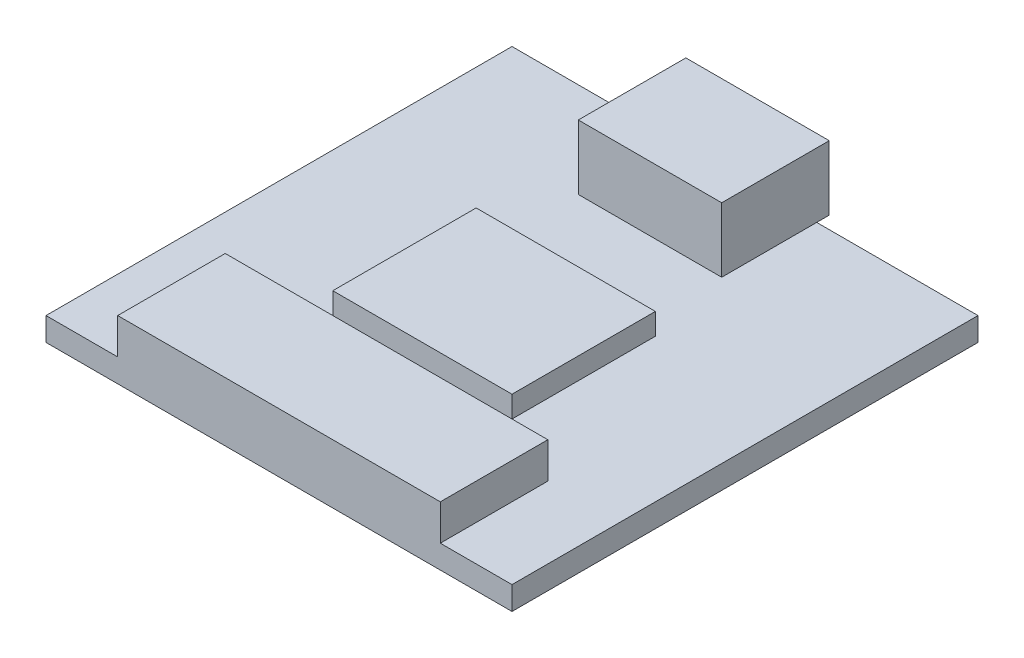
ISO-10303-21;
HEADER;
FILE_DESCRIPTION(('STEP AP214'),'2;1');
FILE_NAME('part.step','',(''),(''),'','','');
FILE_SCHEMA(('AUTOMOTIVE_DESIGN { 1 0 10303 214 1 1 1 1 }'));
ENDSEC;
DATA;
#1=APPLICATION_CONTEXT('core data for automotive mechanical design processes');
#2=APPLICATION_PROTOCOL_DEFINITION('international standard','automotive_design',2000,#1);
#3=PRODUCT_CONTEXT('',#1,'mechanical');
#4=PRODUCT('Part','Part','',(#3));
#5=PRODUCT_RELATED_PRODUCT_CATEGORY('part','',(#4));
#6=PRODUCT_DEFINITION_FORMATION('','',#4);
#7=PRODUCT_DEFINITION_CONTEXT('part definition',#1,'design');
#8=PRODUCT_DEFINITION('design','',#6,#7);
#9=PRODUCT_DEFINITION_SHAPE('','',#8);
#10=(LENGTH_UNIT() NAMED_UNIT(*) SI_UNIT(.MILLI.,.METRE.));
#11=(NAMED_UNIT(*) PLANE_ANGLE_UNIT() SI_UNIT($,.RADIAN.));
#12=(NAMED_UNIT(*) SI_UNIT($,.STERADIAN.) SOLID_ANGLE_UNIT());
#13=UNCERTAINTY_MEASURE_WITH_UNIT(LENGTH_MEASURE(1.E-05),#10,'distance_accuracy_value','');
#14=(GEOMETRIC_REPRESENTATION_CONTEXT(3) GLOBAL_UNCERTAINTY_ASSIGNED_CONTEXT((#13)) GLOBAL_UNIT_ASSIGNED_CONTEXT((#10,
#11,#12)) REPRESENTATION_CONTEXT('',''));
#15=CARTESIAN_POINT('',(0.,0.,0.));
#16=DIRECTION('',(0.,0.,1.));
#17=DIRECTION('',(1.,0.,0.));
#18=AXIS2_PLACEMENT_3D('',#15,#16,#17);
#19=CARTESIAN_POINT('',(-4.,9.,-68.7));
#20=DIRECTION('',(0.,1.,0.));
#21=DIRECTION('',(0.,0.,1.));
#22=AXIS2_PLACEMENT_3D('',#19,#20,#21);
#23=PLANE('',#22);
#24=DIRECTION('',(1.,0.,0.));
#25=VECTOR('',#24,1.);
#26=CARTESIAN_POINT('',(-4.,9.,-62.7));
#27=LINE('',#26,#25);
#28=CARTESIAN_POINT('',(4.,9.,-62.7));
#29=VERTEX_POINT('',#28);
#30=CARTESIAN_POINT('',(-4.,9.,-62.7));
#31=VERTEX_POINT('',#30);
#32=EDGE_CURVE('E150',#29,#31,#27,.F.);
#33=ORIENTED_EDGE('',*,*,#32,.F.);
#34=DIRECTION('',(0.,0.,-1.));
#35=VECTOR('',#34,1.);
#36=CARTESIAN_POINT('',(4.,9.,-68.7));
#37=LINE('',#36,#35);
#38=CARTESIAN_POINT('',(4.,9.,-68.7));
#39=VERTEX_POINT('',#38);
#40=EDGE_CURVE('E132',#39,#29,#37,.F.);
#41=ORIENTED_EDGE('',*,*,#40,.F.);
#42=DIRECTION('',(1.,0.,0.));
#43=VECTOR('',#42,1.);
#44=CARTESIAN_POINT('',(-4.,9.,-68.7));
#45=LINE('',#44,#43);
#46=CARTESIAN_POINT('',(-4.,9.,-68.7));
#47=VERTEX_POINT('',#46);
#48=EDGE_CURVE('E19',#39,#47,#45,.F.);
#49=ORIENTED_EDGE('',*,*,#48,.T.);
#50=DIRECTION('',(0.,0.,-1.));
#51=VECTOR('',#50,1.);
#52=CARTESIAN_POINT('',(-4.,9.,-68.7));
#53=LINE('',#52,#51);
#54=EDGE_CURVE('E157',#47,#31,#53,.F.);
#55=ORIENTED_EDGE('',*,*,#54,.T.);
#56=EDGE_LOOP('',(#33,#41,#49,#55));
#57=FACE_BOUND('',#56,.T.);
#58=ADVANCED_FACE('F16',(#57),#23,.T.);
#59=CARTESIAN_POINT('',(-5.,6.6,-58.));
#60=DIRECTION('',(0.,1.,0.));
#61=DIRECTION('',(0.,0.,1.));
#62=AXIS2_PLACEMENT_3D('',#59,#60,#61);
#63=PLANE('',#62);
#64=DIRECTION('',(1.,0.,0.));
#65=VECTOR('',#64,1.);
#66=CARTESIAN_POINT('',(-5.,6.6,-50.));
#67=LINE('',#66,#65);
#68=CARTESIAN_POINT('',(5.,6.6,-50.));
#69=VERTEX_POINT('',#68);
#70=CARTESIAN_POINT('',(-5.,6.6,-50.));
#71=VERTEX_POINT('',#70);
#72=EDGE_CURVE('E175',#69,#71,#67,.F.);
#73=ORIENTED_EDGE('',*,*,#72,.F.);
#74=DIRECTION('',(0.,0.,-1.));
#75=VECTOR('',#74,1.);
#76=CARTESIAN_POINT('',(5.,6.6,-58.));
#77=LINE('',#76,#75);
#78=CARTESIAN_POINT('',(5.,6.6,-58.));
#79=VERTEX_POINT('',#78);
#80=EDGE_CURVE('E192',#79,#69,#77,.F.);
#81=ORIENTED_EDGE('',*,*,#80,.F.);
#82=DIRECTION('',(1.,0.,0.));
#83=VECTOR('',#82,1.);
#84=CARTESIAN_POINT('',(-5.,6.6,-58.));
#85=LINE('',#84,#83);
#86=CARTESIAN_POINT('',(-5.,6.6,-58.));
#87=VERTEX_POINT('',#86);
#88=EDGE_CURVE('E186',#79,#87,#85,.F.);
#89=ORIENTED_EDGE('',*,*,#88,.T.);
#90=DIRECTION('',(0.,0.,-1.));
#91=VECTOR('',#90,1.);
#92=CARTESIAN_POINT('',(-5.,6.6,-58.));
#93=LINE('',#92,#91);
#94=EDGE_CURVE('E177',#87,#71,#93,.F.);
#95=ORIENTED_EDGE('',*,*,#94,.T.);
#96=EDGE_LOOP('',(#73,#81,#89,#95));
#97=FACE_BOUND('',#96,.T.);
#98=ADVANCED_FACE('F348',(#97),#63,.T.);
#99=CARTESIAN_POINT('',(-4.,5.4,-68.7));
#100=DIRECTION('',(0.,0.,1.));
#101=DIRECTION('',(1.,0.,0.));
#102=AXIS2_PLACEMENT_3D('',#99,#100,#101);
#103=PLANE('',#102);
#104=DIRECTION('',(0.,1.,0.));
#105=VECTOR('',#104,1.);
#106=CARTESIAN_POINT('',(4.,5.4,-68.7));
#107=LINE('',#106,#105);
#108=CARTESIAN_POINT('',(4.,5.4,-68.7));
#109=VERTEX_POINT('',#108);
#110=EDGE_CURVE('E139',#109,#39,#107,.T.);
#111=ORIENTED_EDGE('',*,*,#110,.F.);
#112=DIRECTION('',(1.,0.,0.));
#113=VECTOR('',#112,1.);
#114=CARTESIAN_POINT('',(-4.,5.4,-68.7));
#115=LINE('',#114,#113);
#116=CARTESIAN_POINT('',(-4.,5.4,-68.7));
#117=VERTEX_POINT('',#116);
#118=EDGE_CURVE('E197',#109,#117,#115,.F.);
#119=ORIENTED_EDGE('',*,*,#118,.T.);
#120=DIRECTION('',(0.,1.,0.));
#121=VECTOR('',#120,1.);
#122=CARTESIAN_POINT('',(-4.,5.4,-68.7));
#123=LINE('',#122,#121);
#124=EDGE_CURVE('E141',#117,#47,#123,.T.);
#125=ORIENTED_EDGE('',*,*,#124,.T.);
#126=ORIENTED_EDGE('',*,*,#48,.F.);
#127=EDGE_LOOP('',(#111,#119,#125,#126));
#128=FACE_BOUND('',#127,.T.);
#129=ADVANCED_FACE('F137',(#128),#103,.F.);
#130=CARTESIAN_POINT('',(-9.,7.4,-48.));
#131=DIRECTION('',(0.,1.,0.));
#132=DIRECTION('',(0.,0.,1.));
#133=AXIS2_PLACEMENT_3D('',#130,#131,#132);
#134=PLANE('',#133);
#135=DIRECTION('',(1.,0.,0.));
#136=VECTOR('',#135,1.);
#137=CARTESIAN_POINT('',(-9.,7.4,-42.));
#138=LINE('',#137,#136);
#139=CARTESIAN_POINT('',(9.,7.4,-42.));
#140=VERTEX_POINT('',#139);
#141=CARTESIAN_POINT('',(-9.,7.4,-42.));
#142=VERTEX_POINT('',#141);
#143=EDGE_CURVE('E207',#140,#142,#138,.F.);
#144=ORIENTED_EDGE('',*,*,#143,.F.);
#145=DIRECTION('',(0.,0.,-1.));
#146=VECTOR('',#145,1.);
#147=CARTESIAN_POINT('',(9.,7.4,-48.));
#148=LINE('',#147,#146);
#149=CARTESIAN_POINT('',(9.,7.4,-48.));
#150=VERTEX_POINT('',#149);
#151=EDGE_CURVE('E173',#150,#140,#148,.F.);
#152=ORIENTED_EDGE('',*,*,#151,.F.);
#153=DIRECTION('',(1.,0.,0.));
#154=VECTOR('',#153,1.);
#155=CARTESIAN_POINT('',(-9.,7.4,-48.));
#156=LINE('',#155,#154);
#157=CARTESIAN_POINT('',(-9.,7.4,-48.));
#158=VERTEX_POINT('',#157);
#159=EDGE_CURVE('E167',#150,#158,#156,.F.);
#160=ORIENTED_EDGE('',*,*,#159,.T.);
#161=DIRECTION('',(0.,0.,-1.));
#162=VECTOR('',#161,1.);
#163=CARTESIAN_POINT('',(-9.,7.4,-48.));
#164=LINE('',#163,#162);
#165=EDGE_CURVE('E162',#158,#142,#164,.F.);
#166=ORIENTED_EDGE('',*,*,#165,.T.);
#167=EDGE_LOOP('',(#144,#152,#160,#166));
#168=FACE_BOUND('',#167,.T.);
#169=ADVANCED_FACE('F343',(#168),#134,.T.);
#170=CARTESIAN_POINT('',(4.,5.4,-68.7));
#171=DIRECTION('',(1.,0.,0.));
#172=DIRECTION('',(0.,0.,-1.));
#173=AXIS2_PLACEMENT_3D('',#170,#171,#172);
#174=PLANE('',#173);
#175=DIRECTION('',(0.,1.,0.));
#176=VECTOR('',#175,1.);
#177=CARTESIAN_POINT('',(4.,5.4,-62.7));
#178=LINE('',#177,#176);
#179=CARTESIAN_POINT('',(4.,5.4,-62.7));
#180=VERTEX_POINT('',#179);
#181=EDGE_CURVE('E151',#180,#29,#178,.T.);
#182=ORIENTED_EDGE('',*,*,#181,.F.);
#183=DIRECTION('',(0.,0.,1.));
#184=VECTOR('',#183,1.);
#185=CARTESIAN_POINT('',(4.,5.4,-68.));
#186=LINE('',#185,#184);
#187=CARTESIAN_POINT('',(4.,5.4,-68.));
#188=VERTEX_POINT('',#187);
#189=EDGE_CURVE('E210',#188,#180,#186,.T.);
#190=ORIENTED_EDGE('',*,*,#189,.F.);
#191=DIRECTION('',(0.,0.,1.));
#192=VECTOR('',#191,1.);
#193=CARTESIAN_POINT('',(4.,5.4,-68.7));
#194=LINE('',#193,#192);
#195=EDGE_CURVE('E148',#188,#109,#194,.F.);
#196=ORIENTED_EDGE('',*,*,#195,.T.);
#197=ORIENTED_EDGE('',*,*,#110,.T.);
#198=ORIENTED_EDGE('',*,*,#40,.T.);
#199=EDGE_LOOP('',(#182,#190,#196,#197,#198));
#200=FACE_BOUND('',#199,.T.);
#201=ADVANCED_FACE('F146',(#200),#174,.T.);
#202=CARTESIAN_POINT('',(-4.,5.4,-62.7));
#203=DIRECTION('',(0.,0.,1.));
#204=DIRECTION('',(1.,0.,0.));
#205=AXIS2_PLACEMENT_3D('',#202,#203,#204);
#206=PLANE('',#205);
#207=ORIENTED_EDGE('',*,*,#181,.T.);
#208=ORIENTED_EDGE('',*,*,#32,.T.);
#209=DIRECTION('',(0.,1.,0.));
#210=VECTOR('',#209,1.);
#211=CARTESIAN_POINT('',(-4.,5.4,-62.7));
#212=LINE('',#211,#210);
#213=CARTESIAN_POINT('',(-4.,5.4,-62.7));
#214=VERTEX_POINT('',#213);
#215=EDGE_CURVE('E159',#31,#214,#212,.F.);
#216=ORIENTED_EDGE('',*,*,#215,.T.);
#217=DIRECTION('',(1.,0.,0.));
#218=VECTOR('',#217,1.);
#219=CARTESIAN_POINT('',(-13.,5.4,-62.7));
#220=LINE('',#219,#218);
#221=EDGE_CURVE('E212',#180,#214,#220,.F.);
#222=ORIENTED_EDGE('',*,*,#221,.F.);
#223=EDGE_LOOP('',(#207,#208,#216,#222));
#224=FACE_BOUND('',#223,.T.);
#225=ADVANCED_FACE('F336',(#224),#206,.T.);
#226=CARTESIAN_POINT('',(-4.,5.4,-68.7));
#227=DIRECTION('',(1.,0.,0.));
#228=DIRECTION('',(0.,0.,-1.));
#229=AXIS2_PLACEMENT_3D('',#226,#227,#228);
#230=PLANE('',#229);
#231=ORIENTED_EDGE('',*,*,#215,.F.);
#232=ORIENTED_EDGE('',*,*,#54,.F.);
#233=ORIENTED_EDGE('',*,*,#124,.F.);
#234=DIRECTION('',(0.,0.,1.));
#235=VECTOR('',#234,1.);
#236=CARTESIAN_POINT('',(-4.,5.4,-68.7));
#237=LINE('',#236,#235);
#238=CARTESIAN_POINT('',(-4.,5.4,-68.));
#239=VERTEX_POINT('',#238);
#240=EDGE_CURVE('E199',#117,#239,#237,.T.);
#241=ORIENTED_EDGE('',*,*,#240,.T.);
#242=DIRECTION('',(0.,0.,1.));
#243=VECTOR('',#242,1.);
#244=CARTESIAN_POINT('',(-4.,5.4,-68.));
#245=LINE('',#244,#243);
#246=EDGE_CURVE('E214',#214,#239,#245,.F.);
#247=ORIENTED_EDGE('',*,*,#246,.F.);
#248=EDGE_LOOP('',(#231,#232,#233,#241,#247));
#249=FACE_BOUND('',#248,.T.);
#250=ADVANCED_FACE('F332',(#249),#230,.F.);
#251=CARTESIAN_POINT('',(-9.,5.4,-48.));
#252=DIRECTION('',(1.,0.,0.));
#253=DIRECTION('',(0.,0.,-1.));
#254=AXIS2_PLACEMENT_3D('',#251,#252,#253);
#255=PLANE('',#254);
#256=ORIENTED_EDGE('',*,*,#165,.F.);
#257=DIRECTION('',(0.,1.,0.));
#258=VECTOR('',#257,1.);
#259=CARTESIAN_POINT('',(-9.,5.4,-48.));
#260=LINE('',#259,#258);
#261=CARTESIAN_POINT('',(-9.,5.4,-48.));
#262=VERTEX_POINT('',#261);
#263=EDGE_CURVE('E164',#158,#262,#260,.F.);
#264=ORIENTED_EDGE('',*,*,#263,.T.);
#265=DIRECTION('',(0.,0.,1.));
#266=VECTOR('',#265,1.);
#267=CARTESIAN_POINT('',(-9.,5.4,-68.));
#268=LINE('',#267,#266);
#269=CARTESIAN_POINT('',(-9.,5.4,-42.));
#270=VERTEX_POINT('',#269);
#271=EDGE_CURVE('E216',#270,#262,#268,.F.);
#272=ORIENTED_EDGE('',*,*,#271,.F.);
#273=DIRECTION('',(0.,1.,0.));
#274=VECTOR('',#273,1.);
#275=CARTESIAN_POINT('',(-9.,5.4,-42.));
#276=LINE('',#275,#274);
#277=EDGE_CURVE('E202',#142,#270,#276,.F.);
#278=ORIENTED_EDGE('',*,*,#277,.F.);
#279=EDGE_LOOP('',(#256,#264,#272,#278));
#280=FACE_BOUND('',#279,.T.);
#281=ADVANCED_FACE('F328',(#280),#255,.F.);
#282=CARTESIAN_POINT('',(-9.,5.4,-48.));
#283=DIRECTION('',(0.,0.,1.));
#284=DIRECTION('',(1.,0.,0.));
#285=AXIS2_PLACEMENT_3D('',#282,#283,#284);
#286=PLANE('',#285);
#287=DIRECTION('',(0.,1.,0.));
#288=VECTOR('',#287,1.);
#289=CARTESIAN_POINT('',(9.,5.4,-48.));
#290=LINE('',#289,#288);
#291=CARTESIAN_POINT('',(9.,5.4,-48.));
#292=VERTEX_POINT('',#291);
#293=EDGE_CURVE('E170',#292,#150,#290,.T.);
#294=ORIENTED_EDGE('',*,*,#293,.F.);
#295=DIRECTION('',(1.,0.,0.));
#296=VECTOR('',#295,1.);
#297=CARTESIAN_POINT('',(-13.,5.4,-48.));
#298=LINE('',#297,#296);
#299=EDGE_CURVE('E218',#262,#292,#298,.T.);
#300=ORIENTED_EDGE('',*,*,#299,.F.);
#301=ORIENTED_EDGE('',*,*,#263,.F.);
#302=ORIENTED_EDGE('',*,*,#159,.F.);
#303=EDGE_LOOP('',(#294,#300,#301,#302));
#304=FACE_BOUND('',#303,.T.);
#305=ADVANCED_FACE('F324',(#304),#286,.F.);
#306=CARTESIAN_POINT('',(9.,5.4,-48.));
#307=DIRECTION('',(1.,0.,0.));
#308=DIRECTION('',(0.,0.,-1.));
#309=AXIS2_PLACEMENT_3D('',#306,#307,#308);
#310=PLANE('',#309);
#311=ORIENTED_EDGE('',*,*,#151,.T.);
#312=DIRECTION('',(0.,1.,0.));
#313=VECTOR('',#312,1.);
#314=CARTESIAN_POINT('',(9.,5.4,-42.));
#315=LINE('',#314,#313);
#316=CARTESIAN_POINT('',(9.,5.4,-42.));
#317=VERTEX_POINT('',#316);
#318=EDGE_CURVE('E204',#317,#140,#315,.T.);
#319=ORIENTED_EDGE('',*,*,#318,.F.);
#320=DIRECTION('',(0.,0.,1.));
#321=VECTOR('',#320,1.);
#322=CARTESIAN_POINT('',(9.,5.4,-68.));
#323=LINE('',#322,#321);
#324=EDGE_CURVE('E220',#292,#317,#323,.T.);
#325=ORIENTED_EDGE('',*,*,#324,.F.);
#326=ORIENTED_EDGE('',*,*,#293,.T.);
#327=EDGE_LOOP('',(#311,#319,#325,#326));
#328=FACE_BOUND('',#327,.T.);
#329=ADVANCED_FACE('F320',(#328),#310,.T.);
#330=CARTESIAN_POINT('',(-5.,5.4,-50.));
#331=DIRECTION('',(0.,0.,1.));
#332=DIRECTION('',(1.,0.,0.));
#333=AXIS2_PLACEMENT_3D('',#330,#331,#332);
#334=PLANE('',#333);
#335=DIRECTION('',(0.,1.,0.));
#336=VECTOR('',#335,1.);
#337=CARTESIAN_POINT('',(5.,5.4,-50.));
#338=LINE('',#337,#336);
#339=CARTESIAN_POINT('',(5.,5.4,-50.));
#340=VERTEX_POINT('',#339);
#341=EDGE_CURVE('E194',#69,#340,#338,.F.);
#342=ORIENTED_EDGE('',*,*,#341,.F.);
#343=ORIENTED_EDGE('',*,*,#72,.T.);
#344=DIRECTION('',(0.,1.,0.));
#345=VECTOR('',#344,1.);
#346=CARTESIAN_POINT('',(-5.,5.4,-50.));
#347=LINE('',#346,#345);
#348=CARTESIAN_POINT('',(-5.,5.4,-50.));
#349=VERTEX_POINT('',#348);
#350=EDGE_CURVE('E180',#71,#349,#347,.F.);
#351=ORIENTED_EDGE('',*,*,#350,.T.);
#352=DIRECTION('',(1.,0.,0.));
#353=VECTOR('',#352,1.);
#354=CARTESIAN_POINT('',(-13.,5.4,-50.));
#355=LINE('',#354,#353);
#356=EDGE_CURVE('E222',#340,#349,#355,.F.);
#357=ORIENTED_EDGE('',*,*,#356,.F.);
#358=EDGE_LOOP('',(#342,#343,#351,#357));
#359=FACE_BOUND('',#358,.T.);
#360=ADVANCED_FACE('F316',(#359),#334,.T.);
#361=CARTESIAN_POINT('',(-5.,5.4,-58.));
#362=DIRECTION('',(1.,0.,0.));
#363=DIRECTION('',(0.,0.,-1.));
#364=AXIS2_PLACEMENT_3D('',#361,#362,#363);
#365=PLANE('',#364);
#366=ORIENTED_EDGE('',*,*,#94,.F.);
#367=DIRECTION('',(0.,1.,0.));
#368=VECTOR('',#367,1.);
#369=CARTESIAN_POINT('',(-5.,5.4,-58.));
#370=LINE('',#369,#368);
#371=CARTESIAN_POINT('',(-5.,5.4,-58.));
#372=VERTEX_POINT('',#371);
#373=EDGE_CURVE('E183',#87,#372,#370,.F.);
#374=ORIENTED_EDGE('',*,*,#373,.T.);
#375=DIRECTION('',(0.,0.,1.));
#376=VECTOR('',#375,1.);
#377=CARTESIAN_POINT('',(-5.,5.4,-68.));
#378=LINE('',#377,#376);
#379=EDGE_CURVE('E224',#349,#372,#378,.F.);
#380=ORIENTED_EDGE('',*,*,#379,.F.);
#381=ORIENTED_EDGE('',*,*,#350,.F.);
#382=EDGE_LOOP('',(#366,#374,#380,#381));
#383=FACE_BOUND('',#382,.T.);
#384=ADVANCED_FACE('F312',(#383),#365,.F.);
#385=CARTESIAN_POINT('',(-5.,5.4,-58.));
#386=DIRECTION('',(0.,0.,1.));
#387=DIRECTION('',(1.,0.,0.));
#388=AXIS2_PLACEMENT_3D('',#385,#386,#387);
#389=PLANE('',#388);
#390=DIRECTION('',(0.,1.,0.));
#391=VECTOR('',#390,1.);
#392=CARTESIAN_POINT('',(5.,5.4,-58.));
#393=LINE('',#392,#391);
#394=CARTESIAN_POINT('',(5.,5.4,-58.));
#395=VERTEX_POINT('',#394);
#396=EDGE_CURVE('E189',#395,#79,#393,.T.);
#397=ORIENTED_EDGE('',*,*,#396,.F.);
#398=DIRECTION('',(1.,0.,0.));
#399=VECTOR('',#398,1.);
#400=CARTESIAN_POINT('',(-13.,5.4,-58.));
#401=LINE('',#400,#399);
#402=EDGE_CURVE('E226',#372,#395,#401,.T.);
#403=ORIENTED_EDGE('',*,*,#402,.F.);
#404=ORIENTED_EDGE('',*,*,#373,.F.);
#405=ORIENTED_EDGE('',*,*,#88,.F.);
#406=EDGE_LOOP('',(#397,#403,#404,#405));
#407=FACE_BOUND('',#406,.T.);
#408=ADVANCED_FACE('F308',(#407),#389,.F.);
#409=CARTESIAN_POINT('',(5.,5.4,-58.));
#410=DIRECTION('',(1.,0.,0.));
#411=DIRECTION('',(0.,0.,-1.));
#412=AXIS2_PLACEMENT_3D('',#409,#410,#411);
#413=PLANE('',#412);
#414=ORIENTED_EDGE('',*,*,#80,.T.);
#415=ORIENTED_EDGE('',*,*,#341,.T.);
#416=DIRECTION('',(0.,0.,1.));
#417=VECTOR('',#416,1.);
#418=CARTESIAN_POINT('',(5.,5.4,-68.));
#419=LINE('',#418,#417);
#420=EDGE_CURVE('E228',#395,#340,#419,.T.);
#421=ORIENTED_EDGE('',*,*,#420,.F.);
#422=ORIENTED_EDGE('',*,*,#396,.T.);
#423=EDGE_LOOP('',(#414,#415,#421,#422));
#424=FACE_BOUND('',#423,.T.);
#425=ADVANCED_FACE('F304',(#424),#413,.T.);
#426=CARTESIAN_POINT('',(-4.,5.4,-68.7));
#427=DIRECTION('',(0.,1.,0.));
#428=DIRECTION('',(0.,0.,1.));
#429=AXIS2_PLACEMENT_3D('',#426,#427,#428);
#430=PLANE('',#429);
#431=ORIENTED_EDGE('',*,*,#240,.F.);
#432=ORIENTED_EDGE('',*,*,#118,.F.);
#433=ORIENTED_EDGE('',*,*,#195,.F.);
#434=DIRECTION('',(1.,0.,0.));
#435=VECTOR('',#434,1.);
#436=CARTESIAN_POINT('',(-13.,5.4,-68.));
#437=LINE('',#436,#435);
#438=EDGE_CURVE('E234',#188,#239,#437,.F.);
#439=ORIENTED_EDGE('',*,*,#438,.T.);
#440=EDGE_LOOP('',(#431,#432,#433,#439));
#441=FACE_BOUND('',#440,.T.);
#442=ADVANCED_FACE('F300',(#441),#430,.F.);
#443=CARTESIAN_POINT('',(-13.,5.4,-68.));
#444=DIRECTION('',(0.,1.,0.));
#445=DIRECTION('',(0.,0.,1.));
#446=AXIS2_PLACEMENT_3D('',#443,#444,#445);
#447=PLANE('',#446);
#448=ORIENTED_EDGE('',*,*,#402,.T.);
#449=ORIENTED_EDGE('',*,*,#420,.T.);
#450=ORIENTED_EDGE('',*,*,#356,.T.);
#451=ORIENTED_EDGE('',*,*,#379,.T.);
#452=EDGE_LOOP('',(#448,#449,#450,#451));
#453=FACE_BOUND('',#452,.T.);
#454=ORIENTED_EDGE('',*,*,#299,.T.);
#455=ORIENTED_EDGE('',*,*,#324,.T.);
#456=DIRECTION('',(1.,0.,0.));
#457=VECTOR('',#456,1.);
#458=CARTESIAN_POINT('',(-13.,5.4,-42.));
#459=LINE('',#458,#457);
#460=CARTESIAN_POINT('',(13.,5.4,-42.));
#461=VERTEX_POINT('',#460);
#462=EDGE_CURVE('E246',#461,#317,#459,.F.);
#463=ORIENTED_EDGE('',*,*,#462,.F.);
#464=DIRECTION('',(0.,0.,-1.));
#465=VECTOR('',#464,1.);
#466=CARTESIAN_POINT('',(13.,5.4,-68.));
#467=LINE('',#466,#465);
#468=CARTESIAN_POINT('',(13.,5.4,-68.));
#469=VERTEX_POINT('',#468);
#470=EDGE_CURVE('E255',#469,#461,#467,.F.);
#471=ORIENTED_EDGE('',*,*,#470,.F.);
#472=DIRECTION('',(1.,0.,0.));
#473=VECTOR('',#472,1.);
#474=CARTESIAN_POINT('',(-13.,5.4,-68.));
#475=LINE('',#474,#473);
#476=EDGE_CURVE('E231',#469,#188,#475,.F.);
#477=ORIENTED_EDGE('',*,*,#476,.T.);
#478=ORIENTED_EDGE('',*,*,#189,.T.);
#479=ORIENTED_EDGE('',*,*,#221,.T.);
#480=ORIENTED_EDGE('',*,*,#246,.T.);
#481=DIRECTION('',(1.,0.,0.));
#482=VECTOR('',#481,1.);
#483=CARTESIAN_POINT('',(-13.,5.4,-68.));
#484=LINE('',#483,#482);
#485=CARTESIAN_POINT('',(-13.,5.4,-68.));
#486=VERTEX_POINT('',#485);
#487=EDGE_CURVE('E237',#239,#486,#484,.F.);
#488=ORIENTED_EDGE('',*,*,#487,.T.);
#489=DIRECTION('',(0.,0.,-1.));
#490=VECTOR('',#489,1.);
#491=CARTESIAN_POINT('',(-13.,5.4,-68.));
#492=LINE('',#491,#490);
#493=CARTESIAN_POINT('',(-13.,5.4,-42.));
#494=VERTEX_POINT('',#493);
#495=EDGE_CURVE('E242',#486,#494,#492,.F.);
#496=ORIENTED_EDGE('',*,*,#495,.T.);
#497=DIRECTION('',(1.,0.,0.));
#498=VECTOR('',#497,1.);
#499=CARTESIAN_POINT('',(-13.,5.4,-42.));
#500=LINE('',#499,#498);
#501=EDGE_CURVE('E249',#270,#494,#500,.F.);
#502=ORIENTED_EDGE('',*,*,#501,.F.);
#503=ORIENTED_EDGE('',*,*,#271,.T.);
#504=EDGE_LOOP('',(#454,#455,#463,#471,#477,#478,#479,#480,#488,#496,#502,#503));
#505=FACE_BOUND('',#504,.T.);
#506=ADVANCED_FACE('F297',(#453,#505),#447,.T.);
#507=CARTESIAN_POINT('',(-13.,4.1,-68.));
#508=DIRECTION('',(0.,0.,1.));
#509=DIRECTION('',(1.,0.,0.));
#510=AXIS2_PLACEMENT_3D('',#507,#508,#509);
#511=PLANE('',#510);
#512=ORIENTED_EDGE('',*,*,#438,.F.);
#513=ORIENTED_EDGE('',*,*,#476,.F.);
#514=DIRECTION('',(0.,1.,0.));
#515=VECTOR('',#514,1.);
#516=CARTESIAN_POINT('',(13.,4.1,-68.));
#517=LINE('',#516,#515);
#518=CARTESIAN_POINT('',(13.,4.1,-68.));
#519=VERTEX_POINT('',#518);
#520=EDGE_CURVE('E252',#519,#469,#517,.T.);
#521=ORIENTED_EDGE('',*,*,#520,.F.);
#522=DIRECTION('',(1.,0.,0.));
#523=VECTOR('',#522,1.);
#524=CARTESIAN_POINT('',(-13.,4.1,-68.));
#525=LINE('',#524,#523);
#526=CARTESIAN_POINT('',(-13.,4.1,-68.));
#527=VERTEX_POINT('',#526);
#528=EDGE_CURVE('E258',#519,#527,#525,.F.);
#529=ORIENTED_EDGE('',*,*,#528,.T.);
#530=DIRECTION('',(0.,1.,0.));
#531=VECTOR('',#530,1.);
#532=CARTESIAN_POINT('',(-13.,4.1,-68.));
#533=LINE('',#532,#531);
#534=EDGE_CURVE('E239',#527,#486,#533,.T.);
#535=ORIENTED_EDGE('',*,*,#534,.T.);
#536=ORIENTED_EDGE('',*,*,#487,.F.);
#537=EDGE_LOOP('',(#512,#513,#521,#529,#535,#536));
#538=FACE_BOUND('',#537,.T.);
#539=ADVANCED_FACE('F278',(#538),#511,.F.);
#540=CARTESIAN_POINT('',(-13.,4.1,-68.));
#541=DIRECTION('',(1.,0.,0.));
#542=DIRECTION('',(0.,0.,-1.));
#543=AXIS2_PLACEMENT_3D('',#540,#541,#542);
#544=PLANE('',#543);
#545=ORIENTED_EDGE('',*,*,#495,.F.);
#546=ORIENTED_EDGE('',*,*,#534,.F.);
#547=DIRECTION('',(0.,0.,1.));
#548=VECTOR('',#547,1.);
#549=CARTESIAN_POINT('',(-13.,4.1,-68.));
#550=LINE('',#549,#548);
#551=CARTESIAN_POINT('',(-13.,4.1,-42.));
#552=VERTEX_POINT('',#551);
#553=EDGE_CURVE('E261',#527,#552,#550,.T.);
#554=ORIENTED_EDGE('',*,*,#553,.T.);
#555=DIRECTION('',(0.,1.,0.));
#556=VECTOR('',#555,1.);
#557=CARTESIAN_POINT('',(-13.,4.1,-42.));
#558=LINE('',#557,#556);
#559=EDGE_CURVE('E244',#494,#552,#558,.F.);
#560=ORIENTED_EDGE('',*,*,#559,.F.);
#561=EDGE_LOOP('',(#545,#546,#554,#560));
#562=FACE_BOUND('',#561,.T.);
#563=ADVANCED_FACE('F274',(#562),#544,.F.);
#564=CARTESIAN_POINT('',(-13.,4.1,-42.));
#565=DIRECTION('',(0.,0.,1.));
#566=DIRECTION('',(1.,0.,0.));
#567=AXIS2_PLACEMENT_3D('',#564,#565,#566);
#568=PLANE('',#567);
#569=ORIENTED_EDGE('',*,*,#462,.T.);
#570=ORIENTED_EDGE('',*,*,#318,.T.);
#571=ORIENTED_EDGE('',*,*,#143,.T.);
#572=ORIENTED_EDGE('',*,*,#277,.T.);
#573=ORIENTED_EDGE('',*,*,#501,.T.);
#574=ORIENTED_EDGE('',*,*,#559,.T.);
#575=DIRECTION('',(1.,0.,0.));
#576=VECTOR('',#575,1.);
#577=CARTESIAN_POINT('',(-13.,4.1,-42.));
#578=LINE('',#577,#576);
#579=CARTESIAN_POINT('',(13.,4.1,-42.));
#580=VERTEX_POINT('',#579);
#581=EDGE_CURVE('E25',#552,#580,#578,.T.);
#582=ORIENTED_EDGE('',*,*,#581,.T.);
#583=DIRECTION('',(0.,1.,0.));
#584=VECTOR('',#583,1.);
#585=CARTESIAN_POINT('',(13.,4.1,-42.));
#586=LINE('',#585,#584);
#587=EDGE_CURVE('E33',#461,#580,#586,.F.);
#588=ORIENTED_EDGE('',*,*,#587,.F.);
#589=EDGE_LOOP('',(#569,#570,#571,#572,#573,#574,#582,#588));
#590=FACE_BOUND('',#589,.T.);
#591=ADVANCED_FACE('F267',(#590),#568,.T.);
#592=CARTESIAN_POINT('',(13.,4.1,-68.));
#593=DIRECTION('',(1.,0.,0.));
#594=DIRECTION('',(0.,0.,-1.));
#595=AXIS2_PLACEMENT_3D('',#592,#593,#594);
#596=PLANE('',#595);
#597=ORIENTED_EDGE('',*,*,#470,.T.);
#598=ORIENTED_EDGE('',*,*,#587,.T.);
#599=DIRECTION('',(0.,0.,1.));
#600=VECTOR('',#599,1.);
#601=CARTESIAN_POINT('',(13.,4.1,-68.));
#602=LINE('',#601,#600);
#603=EDGE_CURVE('E10',#580,#519,#602,.F.);
#604=ORIENTED_EDGE('',*,*,#603,.T.);
#605=ORIENTED_EDGE('',*,*,#520,.T.);
#606=EDGE_LOOP('',(#597,#598,#604,#605));
#607=FACE_BOUND('',#606,.T.);
#608=ADVANCED_FACE('F281',(#607),#596,.T.);
#609=CARTESIAN_POINT('',(-13.,4.1,-68.));
#610=DIRECTION('',(0.,1.,0.));
#611=DIRECTION('',(0.,0.,1.));
#612=AXIS2_PLACEMENT_3D('',#609,#610,#611);
#613=PLANE('',#612);
#614=ORIENTED_EDGE('',*,*,#581,.F.);
#615=ORIENTED_EDGE('',*,*,#553,.F.);
#616=ORIENTED_EDGE('',*,*,#528,.F.);
#617=ORIENTED_EDGE('',*,*,#603,.F.);
#618=EDGE_LOOP('',(#614,#615,#616,#617));
#619=FACE_BOUND('',#618,.T.);
#620=ADVANCED_FACE('F271',(#619),#613,.F.);
#621=CLOSED_SHELL('',(#58,#98,#129,#169,#201,#225,#250,#281,#305,#329,#360,#384,#408,#425,#442,
#506,#539,#563,#591,#608,#620));
#622=MANIFOLD_SOLID_BREP('B1',#621);
#623=ADVANCED_BREP_SHAPE_REPRESENTATION('',(#18,#622),#14);
#624=SHAPE_DEFINITION_REPRESENTATION(#9,#623);
ENDSEC;
END-ISO-10303-21;
